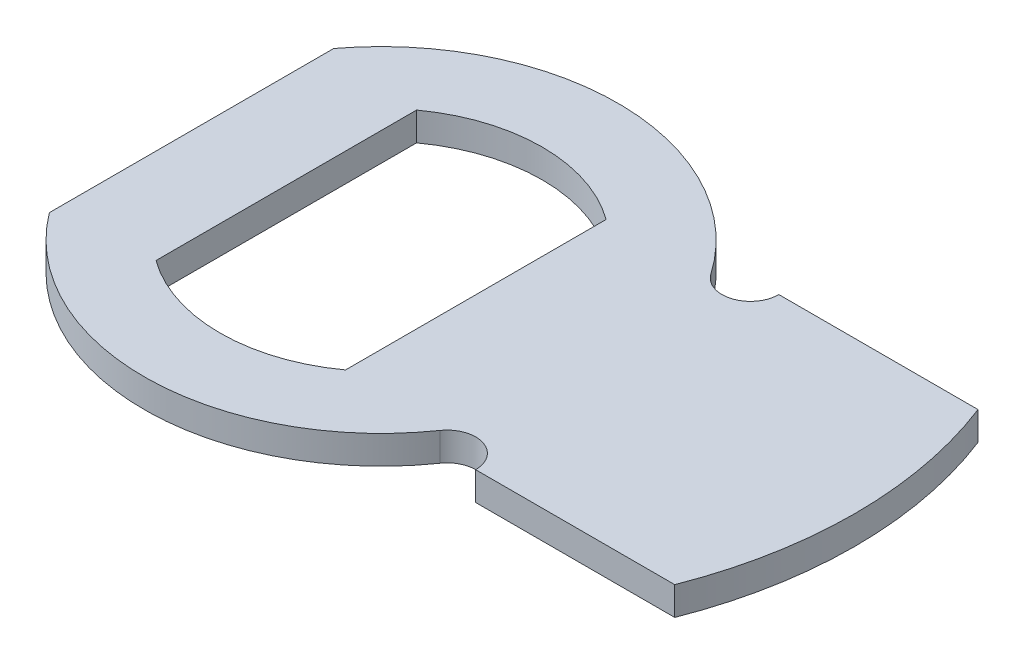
ISO-10303-21;
HEADER;
FILE_DESCRIPTION(('STEP AP214'),'2;1');
FILE_NAME('part.step','',(''),(''),'','','');
FILE_SCHEMA(('AUTOMOTIVE_DESIGN { 1 0 10303 214 1 1 1 1 }'));
ENDSEC;
DATA;
#1=APPLICATION_CONTEXT('core data for automotive mechanical design processes');
#2=APPLICATION_PROTOCOL_DEFINITION('international standard','automotive_design',2000,#1);
#3=PRODUCT_CONTEXT('',#1,'mechanical');
#4=PRODUCT('Part','Part','',(#3));
#5=PRODUCT_RELATED_PRODUCT_CATEGORY('part','',(#4));
#6=PRODUCT_DEFINITION_FORMATION('','',#4);
#7=PRODUCT_DEFINITION_CONTEXT('part definition',#1,'design');
#8=PRODUCT_DEFINITION('design','',#6,#7);
#9=PRODUCT_DEFINITION_SHAPE('','',#8);
#10=(LENGTH_UNIT() NAMED_UNIT(*) SI_UNIT(.MILLI.,.METRE.));
#11=(NAMED_UNIT(*) PLANE_ANGLE_UNIT() SI_UNIT($,.RADIAN.));
#12=(NAMED_UNIT(*) SI_UNIT($,.STERADIAN.) SOLID_ANGLE_UNIT());
#13=UNCERTAINTY_MEASURE_WITH_UNIT(LENGTH_MEASURE(1.E-05),#10,'distance_accuracy_value','');
#14=(GEOMETRIC_REPRESENTATION_CONTEXT(3) GLOBAL_UNCERTAINTY_ASSIGNED_CONTEXT((#13)) GLOBAL_UNIT_ASSIGNED_CONTEXT((#10,
#11,#12)) REPRESENTATION_CONTEXT('',''));
#15=CARTESIAN_POINT('',(0.,0.,0.));
#16=DIRECTION('',(0.,0.,1.));
#17=DIRECTION('',(1.,0.,0.));
#18=AXIS2_PLACEMENT_3D('',#15,#16,#17);
#19=CARTESIAN_POINT('',(0.,3.,0.));
#20=DIRECTION('',(0.,1.,0.));
#21=DIRECTION('',(0.,0.,1.));
#22=AXIS2_PLACEMENT_3D('',#19,#20,#21);
#23=PLANE('',#22);
#24=CARTESIAN_POINT('',(0.,3.,0.));
#25=DIRECTION('',(0.,1.,0.));
#26=DIRECTION('',(0.,0.,1.));
#27=AXIS2_PLACEMENT_3D('',#24,#25,#26);
#28=CIRCLE('',#27,25.);
#29=CARTESIAN_POINT('',(-20.,3.,15.));
#30=VERTEX_POINT('',#29);
#31=CARTESIAN_POINT('',(20.5162951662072,3.,14.2857142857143));
#32=VERTEX_POINT('',#31);
#33=EDGE_CURVE('E156',#30,#32,#28,.T.);
#34=ORIENTED_EDGE('',*,*,#33,.T.);
#35=CARTESIAN_POINT('',(22.9782505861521,3.,16.));
#36=DIRECTION('',(0.,-1.,0.));
#37=DIRECTION('',(0.,0.,1.));
#38=AXIS2_PLACEMENT_3D('',#35,#36,#37);
#39=CIRCLE('',#38,3.);
#40=CARTESIAN_POINT('',(25.9782505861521,3.,16.));
#41=VERTEX_POINT('',#40);
#42=EDGE_CURVE('E159',#32,#41,#39,.T.);
#43=ORIENTED_EDGE('',*,*,#42,.T.);
#44=DIRECTION('',(1.,0.,0.));
#45=VECTOR('',#44,1.);
#46=CARTESIAN_POINT('',(25.9782505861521,3.,16.));
#47=LINE('',#46,#45);
#48=CARTESIAN_POINT('',(46.9878030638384,3.,16.));
#49=VERTEX_POINT('',#48);
#50=EDGE_CURVE('E162',#41,#49,#47,.T.);
#51=ORIENTED_EDGE('',*,*,#50,.T.);
#52=CARTESIAN_POINT('',(6.,3.,0.));
#53=DIRECTION('',(0.,1.,0.));
#54=DIRECTION('',(0.,0.,1.));
#55=AXIS2_PLACEMENT_3D('',#52,#53,#54);
#56=CIRCLE('',#55,44.);
#57=CARTESIAN_POINT('',(46.9878030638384,3.,-16.));
#58=VERTEX_POINT('',#57);
#59=EDGE_CURVE('E164',#49,#58,#56,.T.);
#60=ORIENTED_EDGE('',*,*,#59,.T.);
#61=DIRECTION('',(-1.,0.,0.));
#62=VECTOR('',#61,1.);
#63=CARTESIAN_POINT('',(25.9782505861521,3.,-16.));
#64=LINE('',#63,#62);
#65=CARTESIAN_POINT('',(25.9782505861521,3.,-16.));
#66=VERTEX_POINT('',#65);
#67=EDGE_CURVE('E166',#58,#66,#64,.T.);
#68=ORIENTED_EDGE('',*,*,#67,.T.);
#69=CARTESIAN_POINT('',(22.9782505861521,3.,-16.));
#70=DIRECTION('',(0.,-1.,0.));
#71=DIRECTION('',(0.,0.,1.));
#72=AXIS2_PLACEMENT_3D('',#69,#70,#71);
#73=CIRCLE('',#72,3.);
#74=CARTESIAN_POINT('',(20.5162951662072,3.,-14.2857142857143));
#75=VERTEX_POINT('',#74);
#76=EDGE_CURVE('E168',#66,#75,#73,.T.);
#77=ORIENTED_EDGE('',*,*,#76,.T.);
#78=CARTESIAN_POINT('',(0.,3.,0.));
#79=DIRECTION('',(0.,1.,0.));
#80=DIRECTION('',(0.,0.,1.));
#81=AXIS2_PLACEMENT_3D('',#78,#79,#80);
#82=CIRCLE('',#81,25.);
#83=CARTESIAN_POINT('',(-20.,3.,-15.));
#84=VERTEX_POINT('',#83);
#85=EDGE_CURVE('E170',#75,#84,#82,.T.);
#86=ORIENTED_EDGE('',*,*,#85,.T.);
#87=DIRECTION('',(0.,0.,1.));
#88=VECTOR('',#87,1.);
#89=CARTESIAN_POINT('',(-20.,3.,-15.));
#90=LINE('',#89,#88);
#91=EDGE_CURVE('E172',#84,#30,#90,.T.);
#92=ORIENTED_EDGE('',*,*,#91,.T.);
#93=EDGE_LOOP('',(#34,#43,#51,#60,#68,#77,#86,#92));
#94=FACE_BOUND('',#93,.T.);
#95=DIRECTION('',(0.,0.,-1.));
#96=VECTOR('',#95,1.);
#97=CARTESIAN_POINT('',(10.,3.,-13.7477270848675));
#98=LINE('',#97,#96);
#99=CARTESIAN_POINT('',(10.,3.,13.7477270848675));
#100=VERTEX_POINT('',#99);
#101=CARTESIAN_POINT('',(10.,3.,-13.7477270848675));
#102=VERTEX_POINT('',#101);
#103=EDGE_CURVE('E128',#100,#102,#98,.T.);
#104=ORIENTED_EDGE('',*,*,#103,.F.);
#105=CARTESIAN_POINT('',(0.,3.,0.));
#106=DIRECTION('',(0.,1.,0.));
#107=DIRECTION('',(0.,0.,1.));
#108=AXIS2_PLACEMENT_3D('',#105,#106,#107);
#109=CIRCLE('',#108,17.);
#110=CARTESIAN_POINT('',(-10.,3.,13.7477270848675));
#111=VERTEX_POINT('',#110);
#112=EDGE_CURVE('E120',#111,#100,#109,.T.);
#113=ORIENTED_EDGE('',*,*,#112,.F.);
#114=DIRECTION('',(0.,0.,1.));
#115=VECTOR('',#114,1.);
#116=CARTESIAN_POINT('',(-10.,3.,-13.7477270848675));
#117=LINE('',#116,#115);
#118=CARTESIAN_POINT('',(-10.,3.,-13.7477270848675));
#119=VERTEX_POINT('',#118);
#120=EDGE_CURVE('E142',#119,#111,#117,.T.);
#121=ORIENTED_EDGE('',*,*,#120,.F.);
#122=CARTESIAN_POINT('',(0.,3.,0.));
#123=DIRECTION('',(0.,1.,0.));
#124=DIRECTION('',(0.,0.,1.));
#125=AXIS2_PLACEMENT_3D('',#122,#123,#124);
#126=CIRCLE('',#125,17.);
#127=EDGE_CURVE('E140',#102,#119,#126,.T.);
#128=ORIENTED_EDGE('',*,*,#127,.F.);
#129=EDGE_LOOP('',(#104,#113,#121,#128));
#130=FACE_BOUND('',#129,.T.);
#131=ADVANCED_FACE('F31',(#94,#130),#23,.T.);
#132=CARTESIAN_POINT('',(0.,0.,0.));
#133=DIRECTION('',(0.,1.,0.));
#134=DIRECTION('',(0.,0.,1.));
#135=AXIS2_PLACEMENT_3D('',#132,#133,#134);
#136=PLANE('',#135);
#137=CARTESIAN_POINT('',(0.,0.,0.));
#138=DIRECTION('',(0.,1.,0.));
#139=DIRECTION('',(0.,0.,1.));
#140=AXIS2_PLACEMENT_3D('',#137,#138,#139);
#141=CIRCLE('',#140,25.);
#142=CARTESIAN_POINT('',(-20.,0.,15.));
#143=VERTEX_POINT('',#142);
#144=CARTESIAN_POINT('',(20.5162951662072,0.,14.2857142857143));
#145=VERTEX_POINT('',#144);
#146=EDGE_CURVE('E136',#143,#145,#141,.T.);
#147=ORIENTED_EDGE('',*,*,#146,.F.);
#148=DIRECTION('',(0.,0.,1.));
#149=VECTOR('',#148,1.);
#150=CARTESIAN_POINT('',(-20.,0.,-15.));
#151=LINE('',#150,#149);
#152=CARTESIAN_POINT('',(-20.,0.,-15.));
#153=VERTEX_POINT('',#152);
#154=EDGE_CURVE('E160',#153,#143,#151,.T.);
#155=ORIENTED_EDGE('',*,*,#154,.F.);
#156=CARTESIAN_POINT('',(0.,0.,0.));
#157=DIRECTION('',(0.,1.,0.));
#158=DIRECTION('',(0.,0.,1.));
#159=AXIS2_PLACEMENT_3D('',#156,#157,#158);
#160=CIRCLE('',#159,25.);
#161=CARTESIAN_POINT('',(20.5162951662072,0.,-14.2857142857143));
#162=VERTEX_POINT('',#161);
#163=EDGE_CURVE('E187',#162,#153,#160,.T.);
#164=ORIENTED_EDGE('',*,*,#163,.F.);
#165=CARTESIAN_POINT('',(22.9782505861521,0.,-16.));
#166=DIRECTION('',(0.,-1.,0.));
#167=DIRECTION('',(0.,0.,1.));
#168=AXIS2_PLACEMENT_3D('',#165,#166,#167);
#169=CIRCLE('',#168,3.);
#170=CARTESIAN_POINT('',(25.9782505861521,0.,-16.));
#171=VERTEX_POINT('',#170);
#172=EDGE_CURVE('E185',#171,#162,#169,.T.);
#173=ORIENTED_EDGE('',*,*,#172,.F.);
#174=DIRECTION('',(-1.,0.,0.));
#175=VECTOR('',#174,1.);
#176=CARTESIAN_POINT('',(25.9782505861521,0.,-16.));
#177=LINE('',#176,#175);
#178=CARTESIAN_POINT('',(46.9878030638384,0.,-16.));
#179=VERTEX_POINT('',#178);
#180=EDGE_CURVE('E183',#179,#171,#177,.T.);
#181=ORIENTED_EDGE('',*,*,#180,.F.);
#182=CARTESIAN_POINT('',(6.,0.,0.));
#183=DIRECTION('',(0.,1.,0.));
#184=DIRECTION('',(0.,0.,1.));
#185=AXIS2_PLACEMENT_3D('',#182,#183,#184);
#186=CIRCLE('',#185,44.);
#187=CARTESIAN_POINT('',(46.9878030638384,0.,16.));
#188=VERTEX_POINT('',#187);
#189=EDGE_CURVE('E181',#188,#179,#186,.T.);
#190=ORIENTED_EDGE('',*,*,#189,.F.);
#191=DIRECTION('',(1.,0.,0.));
#192=VECTOR('',#191,1.);
#193=CARTESIAN_POINT('',(25.9782505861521,0.,16.));
#194=LINE('',#193,#192);
#195=CARTESIAN_POINT('',(25.9782505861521,0.,16.));
#196=VERTEX_POINT('',#195);
#197=EDGE_CURVE('E179',#196,#188,#194,.T.);
#198=ORIENTED_EDGE('',*,*,#197,.F.);
#199=CARTESIAN_POINT('',(22.9782505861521,0.,16.));
#200=DIRECTION('',(0.,-1.,0.));
#201=DIRECTION('',(0.,0.,1.));
#202=AXIS2_PLACEMENT_3D('',#199,#200,#201);
#203=CIRCLE('',#202,3.);
#204=EDGE_CURVE('E177',#145,#196,#203,.T.);
#205=ORIENTED_EDGE('',*,*,#204,.F.);
#206=EDGE_LOOP('',(#147,#155,#164,#173,#181,#190,#198,#205));
#207=FACE_BOUND('',#206,.T.);
#208=CARTESIAN_POINT('',(0.,0.,0.));
#209=DIRECTION('',(0.,1.,0.));
#210=DIRECTION('',(0.,0.,1.));
#211=AXIS2_PLACEMENT_3D('',#208,#209,#210);
#212=CIRCLE('',#211,17.);
#213=CARTESIAN_POINT('',(-10.,0.,13.7477270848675));
#214=VERTEX_POINT('',#213);
#215=CARTESIAN_POINT('',(10.,0.,13.7477270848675));
#216=VERTEX_POINT('',#215);
#217=EDGE_CURVE('E54',#214,#216,#212,.T.);
#218=ORIENTED_EDGE('',*,*,#217,.T.);
#219=DIRECTION('',(0.,0.,-1.));
#220=VECTOR('',#219,1.);
#221=CARTESIAN_POINT('',(10.,0.,-13.7477270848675));
#222=LINE('',#221,#220);
#223=CARTESIAN_POINT('',(10.,0.,-13.7477270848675));
#224=VERTEX_POINT('',#223);
#225=EDGE_CURVE('E135',#216,#224,#222,.T.);
#226=ORIENTED_EDGE('',*,*,#225,.T.);
#227=CARTESIAN_POINT('',(0.,0.,0.));
#228=DIRECTION('',(0.,1.,0.));
#229=DIRECTION('',(0.,0.,1.));
#230=AXIS2_PLACEMENT_3D('',#227,#228,#229);
#231=CIRCLE('',#230,17.);
#232=CARTESIAN_POINT('',(-10.,0.,-13.7477270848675));
#233=VERTEX_POINT('',#232);
#234=EDGE_CURVE('E148',#224,#233,#231,.T.);
#235=ORIENTED_EDGE('',*,*,#234,.T.);
#236=DIRECTION('',(0.,0.,1.));
#237=VECTOR('',#236,1.);
#238=CARTESIAN_POINT('',(-10.,0.,-13.7477270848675));
#239=LINE('',#238,#237);
#240=EDGE_CURVE('E129',#233,#214,#239,.T.);
#241=ORIENTED_EDGE('',*,*,#240,.T.);
#242=EDGE_LOOP('',(#218,#226,#235,#241));
#243=FACE_BOUND('',#242,.T.);
#244=ADVANCED_FACE('F217',(#207,#243),#136,.F.);
#245=CARTESIAN_POINT('',(0.,3.,0.));
#246=DIRECTION('',(0.,-1.,0.));
#247=DIRECTION('',(0.,0.,-1.));
#248=AXIS2_PLACEMENT_3D('',#245,#246,#247);
#249=CYLINDRICAL_SURFACE('',#248,25.);
#250=ORIENTED_EDGE('',*,*,#146,.T.);
#251=DIRECTION('',(0.,-1.,0.));
#252=VECTOR('',#251,1.);
#253=CARTESIAN_POINT('',(20.5162951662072,3.,14.2857142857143));
#254=LINE('',#253,#252);
#255=EDGE_CURVE('E11',#32,#145,#254,.T.);
#256=ORIENTED_EDGE('',*,*,#255,.F.);
#257=ORIENTED_EDGE('',*,*,#33,.F.);
#258=DIRECTION('',(0.,-1.,0.));
#259=VECTOR('',#258,1.);
#260=CARTESIAN_POINT('',(-20.,3.,15.));
#261=LINE('',#260,#259);
#262=EDGE_CURVE('E174',#30,#143,#261,.T.);
#263=ORIENTED_EDGE('',*,*,#262,.T.);
#264=EDGE_LOOP('',(#250,#256,#257,#263));
#265=FACE_BOUND('',#264,.T.);
#266=ADVANCED_FACE('F33',(#265),#249,.T.);
#267=CARTESIAN_POINT('',(22.9782505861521,3.,16.));
#268=DIRECTION('',(0.,-1.,0.));
#269=DIRECTION('',(0.,0.,-1.));
#270=AXIS2_PLACEMENT_3D('',#267,#268,#269);
#271=CYLINDRICAL_SURFACE('',#270,3.);
#272=ORIENTED_EDGE('',*,*,#204,.T.);
#273=DIRECTION('',(0.,-1.,0.));
#274=VECTOR('',#273,1.);
#275=CARTESIAN_POINT('',(25.9782505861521,3.,16.));
#276=LINE('',#275,#274);
#277=EDGE_CURVE('E39',#41,#196,#276,.T.);
#278=ORIENTED_EDGE('',*,*,#277,.F.);
#279=ORIENTED_EDGE('',*,*,#42,.F.);
#280=ORIENTED_EDGE('',*,*,#255,.T.);
#281=EDGE_LOOP('',(#272,#278,#279,#280));
#282=FACE_BOUND('',#281,.T.);
#283=ADVANCED_FACE('F234',(#282),#271,.F.);
#284=CARTESIAN_POINT('',(25.9782505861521,3.,16.));
#285=DIRECTION('',(0.,0.,-1.));
#286=DIRECTION('',(-1.,0.,0.));
#287=AXIS2_PLACEMENT_3D('',#284,#285,#286);
#288=PLANE('',#287);
#289=ORIENTED_EDGE('',*,*,#197,.T.);
#290=DIRECTION('',(0.,-1.,0.));
#291=VECTOR('',#290,1.);
#292=CARTESIAN_POINT('',(46.9878030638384,3.,16.));
#293=LINE('',#292,#291);
#294=EDGE_CURVE('E204',#49,#188,#293,.T.);
#295=ORIENTED_EDGE('',*,*,#294,.F.);
#296=ORIENTED_EDGE('',*,*,#50,.F.);
#297=ORIENTED_EDGE('',*,*,#277,.T.);
#298=EDGE_LOOP('',(#289,#295,#296,#297));
#299=FACE_BOUND('',#298,.T.);
#300=ADVANCED_FACE('F211',(#299),#288,.F.);
#301=CARTESIAN_POINT('',(6.,3.,0.));
#302=DIRECTION('',(0.,-1.,0.));
#303=DIRECTION('',(0.,0.,-1.));
#304=AXIS2_PLACEMENT_3D('',#301,#302,#303);
#305=CYLINDRICAL_SURFACE('',#304,44.);
#306=ORIENTED_EDGE('',*,*,#189,.T.);
#307=DIRECTION('',(0.,-1.,0.));
#308=VECTOR('',#307,1.);
#309=CARTESIAN_POINT('',(46.9878030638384,3.,-16.));
#310=LINE('',#309,#308);
#311=EDGE_CURVE('E201',#58,#179,#310,.T.);
#312=ORIENTED_EDGE('',*,*,#311,.F.);
#313=ORIENTED_EDGE('',*,*,#59,.F.);
#314=ORIENTED_EDGE('',*,*,#294,.T.);
#315=EDGE_LOOP('',(#306,#312,#313,#314));
#316=FACE_BOUND('',#315,.T.);
#317=ADVANCED_FACE('F223',(#316),#305,.T.);
#318=CARTESIAN_POINT('',(25.9782505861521,3.,-16.));
#319=DIRECTION('',(0.,0.,1.));
#320=DIRECTION('',(1.,0.,0.));
#321=AXIS2_PLACEMENT_3D('',#318,#319,#320);
#322=PLANE('',#321);
#323=ORIENTED_EDGE('',*,*,#180,.T.);
#324=DIRECTION('',(0.,-1.,0.));
#325=VECTOR('',#324,1.);
#326=CARTESIAN_POINT('',(25.9782505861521,3.,-16.));
#327=LINE('',#326,#325);
#328=EDGE_CURVE('E198',#66,#171,#327,.T.);
#329=ORIENTED_EDGE('',*,*,#328,.F.);
#330=ORIENTED_EDGE('',*,*,#67,.F.);
#331=ORIENTED_EDGE('',*,*,#311,.T.);
#332=EDGE_LOOP('',(#323,#329,#330,#331));
#333=FACE_BOUND('',#332,.T.);
#334=ADVANCED_FACE('F227',(#333),#322,.F.);
#335=CARTESIAN_POINT('',(22.9782505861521,3.,-16.));
#336=DIRECTION('',(0.,-1.,0.));
#337=DIRECTION('',(0.,0.,-1.));
#338=AXIS2_PLACEMENT_3D('',#335,#336,#337);
#339=CYLINDRICAL_SURFACE('',#338,3.);
#340=ORIENTED_EDGE('',*,*,#172,.T.);
#341=DIRECTION('',(0.,-1.,0.));
#342=VECTOR('',#341,1.);
#343=CARTESIAN_POINT('',(20.5162951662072,3.,-14.2857142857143));
#344=LINE('',#343,#342);
#345=EDGE_CURVE('E195',#75,#162,#344,.T.);
#346=ORIENTED_EDGE('',*,*,#345,.F.);
#347=ORIENTED_EDGE('',*,*,#76,.F.);
#348=ORIENTED_EDGE('',*,*,#328,.T.);
#349=EDGE_LOOP('',(#340,#346,#347,#348));
#350=FACE_BOUND('',#349,.T.);
#351=ADVANCED_FACE('F247',(#350),#339,.F.);
#352=CARTESIAN_POINT('',(0.,3.,0.));
#353=DIRECTION('',(0.,-1.,0.));
#354=DIRECTION('',(0.,0.,-1.));
#355=AXIS2_PLACEMENT_3D('',#352,#353,#354);
#356=CYLINDRICAL_SURFACE('',#355,25.);
#357=ORIENTED_EDGE('',*,*,#163,.T.);
#358=DIRECTION('',(0.,-1.,0.));
#359=VECTOR('',#358,1.);
#360=CARTESIAN_POINT('',(-20.,3.,-15.));
#361=LINE('',#360,#359);
#362=EDGE_CURVE('E192',#84,#153,#361,.T.);
#363=ORIENTED_EDGE('',*,*,#362,.F.);
#364=ORIENTED_EDGE('',*,*,#85,.F.);
#365=ORIENTED_EDGE('',*,*,#345,.T.);
#366=EDGE_LOOP('',(#357,#363,#364,#365));
#367=FACE_BOUND('',#366,.T.);
#368=ADVANCED_FACE('F245',(#367),#356,.T.);
#369=CARTESIAN_POINT('',(-20.,3.,-15.));
#370=DIRECTION('',(1.,0.,0.));
#371=DIRECTION('',(0.,0.,-1.));
#372=AXIS2_PLACEMENT_3D('',#369,#370,#371);
#373=PLANE('',#372);
#374=ORIENTED_EDGE('',*,*,#154,.T.);
#375=ORIENTED_EDGE('',*,*,#262,.F.);
#376=ORIENTED_EDGE('',*,*,#91,.F.);
#377=ORIENTED_EDGE('',*,*,#362,.T.);
#378=EDGE_LOOP('',(#374,#375,#376,#377));
#379=FACE_BOUND('',#378,.T.);
#380=ADVANCED_FACE('F240',(#379),#373,.F.);
#381=CARTESIAN_POINT('',(0.,3.,0.));
#382=DIRECTION('',(0.,-1.,0.));
#383=DIRECTION('',(0.,0.,-1.));
#384=AXIS2_PLACEMENT_3D('',#381,#382,#383);
#385=CYLINDRICAL_SURFACE('',#384,17.);
#386=ORIENTED_EDGE('',*,*,#217,.F.);
#387=DIRECTION('',(0.,-1.,0.));
#388=VECTOR('',#387,1.);
#389=CARTESIAN_POINT('',(-10.,3.,13.7477270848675));
#390=LINE('',#389,#388);
#391=EDGE_CURVE('E124',#111,#214,#390,.T.);
#392=ORIENTED_EDGE('',*,*,#391,.F.);
#393=ORIENTED_EDGE('',*,*,#112,.T.);
#394=DIRECTION('',(0.,-1.,0.));
#395=VECTOR('',#394,1.);
#396=CARTESIAN_POINT('',(10.,3.,13.7477270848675));
#397=LINE('',#396,#395);
#398=EDGE_CURVE('E123',#100,#216,#397,.T.);
#399=ORIENTED_EDGE('',*,*,#398,.T.);
#400=EDGE_LOOP('',(#386,#392,#393,#399));
#401=FACE_BOUND('',#400,.T.);
#402=ADVANCED_FACE('F122',(#401),#385,.F.);
#403=CARTESIAN_POINT('',(10.,3.,-13.7477270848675));
#404=DIRECTION('',(-1.,0.,0.));
#405=DIRECTION('',(0.,0.,1.));
#406=AXIS2_PLACEMENT_3D('',#403,#404,#405);
#407=PLANE('',#406);
#408=ORIENTED_EDGE('',*,*,#225,.F.);
#409=ORIENTED_EDGE('',*,*,#398,.F.);
#410=ORIENTED_EDGE('',*,*,#103,.T.);
#411=DIRECTION('',(0.,-1.,0.));
#412=VECTOR('',#411,1.);
#413=CARTESIAN_POINT('',(10.,3.,-13.7477270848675));
#414=LINE('',#413,#412);
#415=EDGE_CURVE('E137',#102,#224,#414,.T.);
#416=ORIENTED_EDGE('',*,*,#415,.T.);
#417=EDGE_LOOP('',(#408,#409,#410,#416));
#418=FACE_BOUND('',#417,.T.);
#419=ADVANCED_FACE('F132',(#418),#407,.T.);
#420=CARTESIAN_POINT('',(0.,3.,0.));
#421=DIRECTION('',(0.,-1.,0.));
#422=DIRECTION('',(0.,0.,-1.));
#423=AXIS2_PLACEMENT_3D('',#420,#421,#422);
#424=CYLINDRICAL_SURFACE('',#423,17.);
#425=ORIENTED_EDGE('',*,*,#234,.F.);
#426=ORIENTED_EDGE('',*,*,#415,.F.);
#427=ORIENTED_EDGE('',*,*,#127,.T.);
#428=DIRECTION('',(0.,-1.,0.));
#429=VECTOR('',#428,1.);
#430=CARTESIAN_POINT('',(-10.,3.,-13.7477270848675));
#431=LINE('',#430,#429);
#432=EDGE_CURVE('E46',#119,#233,#431,.T.);
#433=ORIENTED_EDGE('',*,*,#432,.T.);
#434=EDGE_LOOP('',(#425,#426,#427,#433));
#435=FACE_BOUND('',#434,.T.);
#436=ADVANCED_FACE('F272',(#435),#424,.F.);
#437=CARTESIAN_POINT('',(-10.,3.,-13.7477270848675));
#438=DIRECTION('',(1.,0.,0.));
#439=DIRECTION('',(0.,0.,-1.));
#440=AXIS2_PLACEMENT_3D('',#437,#438,#439);
#441=PLANE('',#440);
#442=ORIENTED_EDGE('',*,*,#240,.F.);
#443=ORIENTED_EDGE('',*,*,#432,.F.);
#444=ORIENTED_EDGE('',*,*,#120,.T.);
#445=ORIENTED_EDGE('',*,*,#391,.T.);
#446=EDGE_LOOP('',(#442,#443,#444,#445));
#447=FACE_BOUND('',#446,.T.);
#448=ADVANCED_FACE('F276',(#447),#441,.T.);
#449=CLOSED_SHELL('',(#131,#244,#266,#283,#300,#317,#334,#351,#368,#380,#402,#419,#436,#448));
#450=MANIFOLD_SOLID_BREP('B2',#449);
#451=ADVANCED_BREP_SHAPE_REPRESENTATION('',(#18,#450),#14);
#452=SHAPE_DEFINITION_REPRESENTATION(#9,#451);
ENDSEC;
END-ISO-10303-21;
